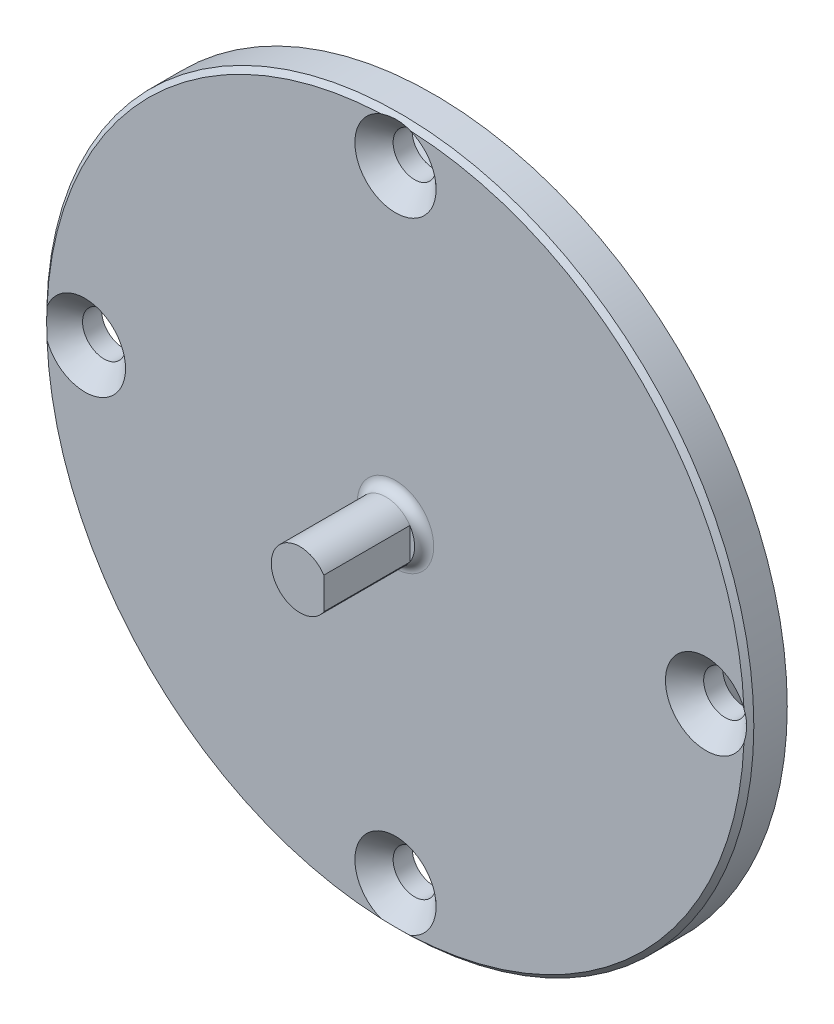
from build123d import *

# Parameters (mm, degrees)
ESQUISSE1_R                  = 37
BASE_EXTRUSION_DEPTH         = 4
ESQUISSE2_R                  = 28.5
ESQUISSE2_R_2                = 23
BOSS_EXTRU_1_DEPTH           = 5
CHANFREIN1_SIZE              = 0.5
ESQUISSE3_R                  = 3
BOSS_EXTRU_2_DEPTH           = 10
CONG_1_R                     = 1
ENL_V_MAT_EXTRU_2_DEPTH      = 55.166410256
ENL_V_MAT_EXTRU_2_DEPTH_BACK = 55.166410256
ESQUISSE4_W                  = 0.5
ESQUISSE4_H                  = 9
R_P_TITION_CIRCULAIRE2_COUNT = 4
CONG_2_R                     = 0.3


with BuildPart() as part:
    # Esquisse1 → Base-Extrusion (new body)
    with BuildSketch(Plane.XY):
        Circle(ESQUISSE1_R)
    extrude(amount=BASE_EXTRUSION_DEPTH)

    # Esquisse2 → Boss.-Extru.1 (add)
    with BuildSketch(Plane(origin=(0, 0, 0), x_dir=(-1, 0, 0), z_dir=(0, 0, -1))):
        with Locations(Location((0, 0, 0), (0, 0, 180))):
            Circle(ESQUISSE2_R)
        Circle(ESQUISSE2_R_2, mode=Mode.SUBTRACT)
    extrude(amount=BOSS_EXTRU_1_DEPTH)

    # Chanfrein1
    chanfrein1_edges = [part.edges().sort_by_distance(p)[0] for p in [
        (-37, 0, 4),
    ]]
    chamfer(chanfrein1_edges, length=CHANFREIN1_SIZE)

    # Esquisse3 → Boss.-Extru.2 (add)
    with BuildSketch(Plane.XY.offset(4)):
        Circle(ESQUISSE3_R)
    extrude(amount=BOSS_EXTRU_2_DEPTH)

    # Cong_1
    cong_1_edges = [part.edges().sort_by_distance(p)[0] for p in [
        (-3, 0, 4),
    ]]
    fillet(cong_1_edges, radius=CONG_1_R)

    # Esquisse4 → Enl_v. mat.-Extru.2 (cut, two sides: drawn at the far end of the back side and taken through both)
    with BuildSketch(Plane(origin=(0, 0, 0), x_dir=(1, 0, 0), z_dir=(0, 1, 0)).offset(-ENL_V_MAT_EXTRU_2_DEPTH_BACK)):
        with Locations((2.75, -9.5)):
            Rectangle(ESQUISSE4_W, ESQUISSE4_H)
    extrude(amount=ENL_V_MAT_EXTRU_2_DEPTH + ENL_V_MAT_EXTRU_2_DEPTH_BACK, mode=Mode.SUBTRACT)

    # Esquisse7 → Per_age1 (revolve, cut)
    with BuildSketch(Plane(origin=(0, 32.5, 4), x_dir=(0, -1, 0), z_dir=(1, 0, 0))):
        Polygon((0, 0), (0, 10.351936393), (2.25, 9), (2.25, 2), (4.25, 0), align=None)
    per_age1 = revolve(axis=Axis((0, 32.5, 18.308894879), (0, 0, -1)), mode=Mode.SUBTRACT)

    # R_p_tition circulaire2: Per_age1 ×4 about axis
    r_p_tition_circulaire2_axis = Axis((0, 0, 0), (0, 0, 1))
    for i in range(1, R_P_TITION_CIRCULAIRE2_COUNT):
        add(per_age1.rotate(r_p_tition_circulaire2_axis, i * 360 / R_P_TITION_CIRCULAIRE2_COUNT), mode=Mode.SUBTRACT)

    # Cong_2
    cong_2_edges = [part.edges().sort_by_distance(p)[0] for p in [
        (-28.5, 0, 0),
    ]]
    fillet(cong_2_edges, radius=CONG_2_R)


solid = part.part
